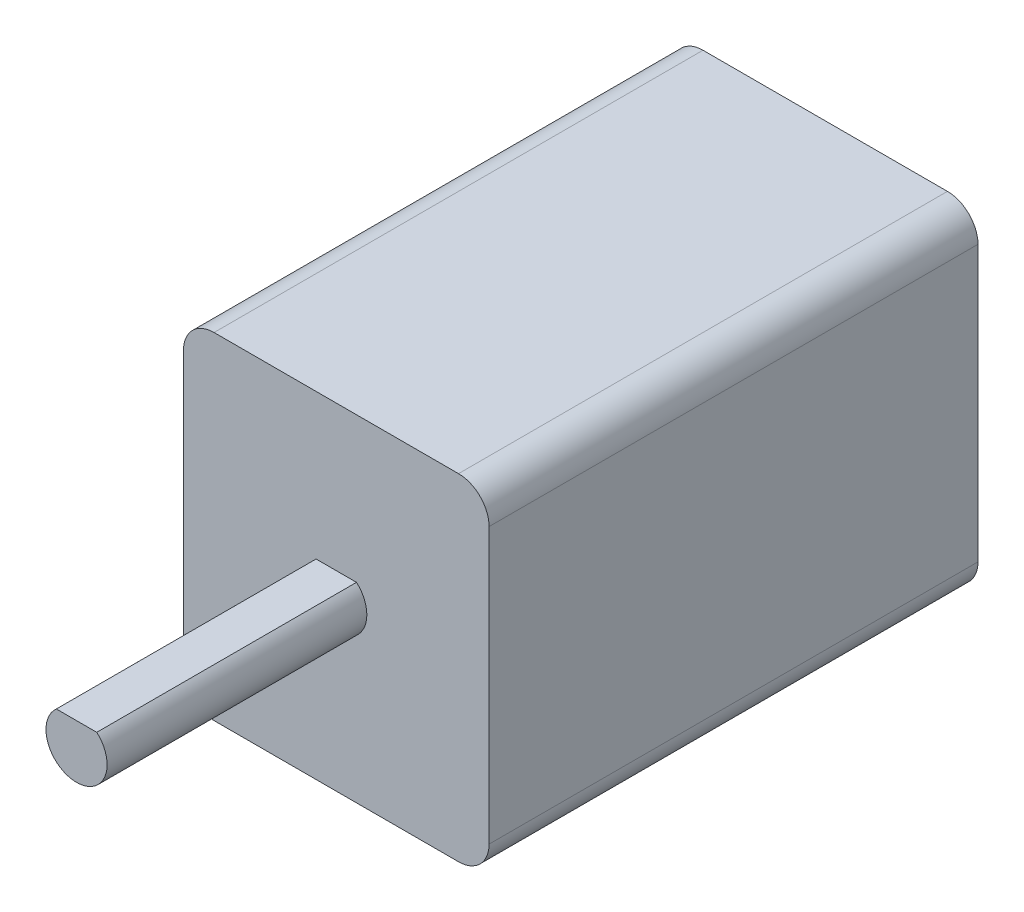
ISO-10303-21;
HEADER;
FILE_DESCRIPTION(('STEP AP214'),'2;1');
FILE_NAME('part.step','',(''),(''),'','','');
FILE_SCHEMA(('AUTOMOTIVE_DESIGN { 1 0 10303 214 1 1 1 1 }'));
ENDSEC;
DATA;
#1=APPLICATION_CONTEXT('core data for automotive mechanical design processes');
#2=APPLICATION_PROTOCOL_DEFINITION('international standard','automotive_design',2000,#1);
#3=PRODUCT_CONTEXT('',#1,'mechanical');
#4=PRODUCT('Part','Part','',(#3));
#5=PRODUCT_RELATED_PRODUCT_CATEGORY('part','',(#4));
#6=PRODUCT_DEFINITION_FORMATION('','',#4);
#7=PRODUCT_DEFINITION_CONTEXT('part definition',#1,'design');
#8=PRODUCT_DEFINITION('design','',#6,#7);
#9=PRODUCT_DEFINITION_SHAPE('','',#8);
#10=(LENGTH_UNIT() NAMED_UNIT(*) SI_UNIT(.MILLI.,.METRE.));
#11=(NAMED_UNIT(*) PLANE_ANGLE_UNIT() SI_UNIT($,.RADIAN.));
#12=(NAMED_UNIT(*) SI_UNIT($,.STERADIAN.) SOLID_ANGLE_UNIT());
#13=UNCERTAINTY_MEASURE_WITH_UNIT(LENGTH_MEASURE(1.E-05),#10,'distance_accuracy_value','');
#14=(GEOMETRIC_REPRESENTATION_CONTEXT(3) GLOBAL_UNCERTAINTY_ASSIGNED_CONTEXT((#13)) GLOBAL_UNIT_ASSIGNED_CONTEXT((#10,
#11,#12)) REPRESENTATION_CONTEXT('',''));
#15=CARTESIAN_POINT('',(0.,0.,0.));
#16=DIRECTION('',(0.,0.,1.));
#17=DIRECTION('',(1.,0.,0.));
#18=AXIS2_PLACEMENT_3D('',#15,#16,#17);
#19=CARTESIAN_POINT('',(10.,-11.,32.));
#20=DIRECTION('',(-1.,0.,0.));
#21=DIRECTION('',(0.,0.,1.));
#22=AXIS2_PLACEMENT_3D('',#19,#20,#21);
#23=PLANE('',#22);
#24=DIRECTION('',(0.,1.,0.));
#25=VECTOR('',#24,1.);
#26=CARTESIAN_POINT('',(10.,-11.,32.));
#27=LINE('',#26,#25);
#28=CARTESIAN_POINT('',(10.,-9.,32.));
#29=VERTEX_POINT('',#28);
#30=CARTESIAN_POINT('',(10.,9.,32.));
#31=VERTEX_POINT('',#30);
#32=EDGE_CURVE('E131',#29,#31,#27,.T.);
#33=ORIENTED_EDGE('',*,*,#32,.F.);
#34=DIRECTION('',(0.,0.,-1.));
#35=VECTOR('',#34,1.);
#36=CARTESIAN_POINT('',(10.,-9.,32.));
#37=LINE('',#36,#35);
#38=CARTESIAN_POINT('',(10.,-9.,0.));
#39=VERTEX_POINT('',#38);
#40=EDGE_CURVE('E154',#29,#39,#37,.T.);
#41=ORIENTED_EDGE('',*,*,#40,.T.);
#42=DIRECTION('',(0.,1.,0.));
#43=VECTOR('',#42,1.);
#44=CARTESIAN_POINT('',(10.,-11.,0.));
#45=LINE('',#44,#43);
#46=CARTESIAN_POINT('',(10.,9.,0.));
#47=VERTEX_POINT('',#46);
#48=EDGE_CURVE('E128',#39,#47,#45,.T.);
#49=ORIENTED_EDGE('',*,*,#48,.T.);
#50=DIRECTION('',(0.,0.,-1.));
#51=VECTOR('',#50,1.);
#52=CARTESIAN_POINT('',(10.,9.,32.));
#53=LINE('',#52,#51);
#54=EDGE_CURVE('E143',#47,#31,#53,.F.);
#55=ORIENTED_EDGE('',*,*,#54,.T.);
#56=EDGE_LOOP('',(#33,#41,#49,#55));
#57=FACE_BOUND('',#56,.T.);
#58=ADVANCED_FACE('F34',(#57),#23,.F.);
#59=CARTESIAN_POINT('',(-10.,11.,32.));
#60=DIRECTION('',(0.,-1.,0.));
#61=DIRECTION('',(0.,0.,-1.));
#62=AXIS2_PLACEMENT_3D('',#59,#60,#61);
#63=PLANE('',#62);
#64=DIRECTION('',(-1.,0.,0.));
#65=VECTOR('',#64,1.);
#66=CARTESIAN_POINT('',(-10.,11.,32.));
#67=LINE('',#66,#65);
#68=CARTESIAN_POINT('',(8.,11.,32.));
#69=VERTEX_POINT('',#68);
#70=CARTESIAN_POINT('',(-8.,11.,32.));
#71=VERTEX_POINT('',#70);
#72=EDGE_CURVE('E134',#69,#71,#67,.T.);
#73=ORIENTED_EDGE('',*,*,#72,.F.);
#74=DIRECTION('',(0.,0.,-1.));
#75=VECTOR('',#74,1.);
#76=CARTESIAN_POINT('',(8.,11.,32.));
#77=LINE('',#76,#75);
#78=CARTESIAN_POINT('',(8.,11.,0.));
#79=VERTEX_POINT('',#78);
#80=EDGE_CURVE('E42',#69,#79,#77,.T.);
#81=ORIENTED_EDGE('',*,*,#80,.T.);
#82=DIRECTION('',(-1.,0.,0.));
#83=VECTOR('',#82,1.);
#84=CARTESIAN_POINT('',(-10.,11.,0.));
#85=LINE('',#84,#83);
#86=CARTESIAN_POINT('',(-8.,11.,0.));
#87=VERTEX_POINT('',#86);
#88=EDGE_CURVE('E146',#79,#87,#85,.T.);
#89=ORIENTED_EDGE('',*,*,#88,.T.);
#90=DIRECTION('',(0.,0.,-1.));
#91=VECTOR('',#90,1.);
#92=CARTESIAN_POINT('',(-8.,11.,32.));
#93=LINE('',#92,#91);
#94=EDGE_CURVE('E182',#87,#71,#93,.F.);
#95=ORIENTED_EDGE('',*,*,#94,.T.);
#96=EDGE_LOOP('',(#73,#81,#89,#95));
#97=FACE_BOUND('',#96,.T.);
#98=ADVANCED_FACE('F188',(#97),#63,.F.);
#99=CARTESIAN_POINT('',(-10.,-11.,32.));
#100=DIRECTION('',(1.,0.,0.));
#101=DIRECTION('',(0.,0.,-1.));
#102=AXIS2_PLACEMENT_3D('',#99,#100,#101);
#103=PLANE('',#102);
#104=DIRECTION('',(0.,-1.,0.));
#105=VECTOR('',#104,1.);
#106=CARTESIAN_POINT('',(-10.,-11.,0.));
#107=LINE('',#106,#105);
#108=CARTESIAN_POINT('',(-10.,9.,0.));
#109=VERTEX_POINT('',#108);
#110=CARTESIAN_POINT('',(-10.,-9.,0.));
#111=VERTEX_POINT('',#110);
#112=EDGE_CURVE('E149',#109,#111,#107,.T.);
#113=ORIENTED_EDGE('',*,*,#112,.T.);
#114=DIRECTION('',(0.,0.,-1.));
#115=VECTOR('',#114,1.);
#116=CARTESIAN_POINT('',(-10.,-9.,32.));
#117=LINE('',#116,#115);
#118=CARTESIAN_POINT('',(-10.,-9.,32.));
#119=VERTEX_POINT('',#118);
#120=EDGE_CURVE('E57',#111,#119,#117,.F.);
#121=ORIENTED_EDGE('',*,*,#120,.T.);
#122=DIRECTION('',(0.,-1.,0.));
#123=VECTOR('',#122,1.);
#124=CARTESIAN_POINT('',(-10.,-11.,32.));
#125=LINE('',#124,#123);
#126=CARTESIAN_POINT('',(-10.,9.,32.));
#127=VERTEX_POINT('',#126);
#128=EDGE_CURVE('E138',#127,#119,#125,.T.);
#129=ORIENTED_EDGE('',*,*,#128,.F.);
#130=DIRECTION('',(0.,0.,-1.));
#131=VECTOR('',#130,1.);
#132=CARTESIAN_POINT('',(-10.,9.,32.));
#133=LINE('',#132,#131);
#134=EDGE_CURVE('E178',#127,#109,#133,.T.);
#135=ORIENTED_EDGE('',*,*,#134,.T.);
#136=EDGE_LOOP('',(#113,#121,#129,#135));
#137=FACE_BOUND('',#136,.T.);
#138=ADVANCED_FACE('F199',(#137),#103,.F.);
#139=CARTESIAN_POINT('',(-10.,-11.,32.));
#140=DIRECTION('',(0.,1.,0.));
#141=DIRECTION('',(0.,0.,1.));
#142=AXIS2_PLACEMENT_3D('',#139,#140,#141);
#143=PLANE('',#142);
#144=DIRECTION('',(1.,0.,0.));
#145=VECTOR('',#144,1.);
#146=CARTESIAN_POINT('',(-10.,-11.,0.));
#147=LINE('',#146,#145);
#148=CARTESIAN_POINT('',(-8.,-11.,0.));
#149=VERTEX_POINT('',#148);
#150=CARTESIAN_POINT('',(8.,-11.,0.));
#151=VERTEX_POINT('',#150);
#152=EDGE_CURVE('E135',#149,#151,#147,.T.);
#153=ORIENTED_EDGE('',*,*,#152,.T.);
#154=DIRECTION('',(0.,0.,-1.));
#155=VECTOR('',#154,1.);
#156=CARTESIAN_POINT('',(8.,-11.,32.));
#157=LINE('',#156,#155);
#158=CARTESIAN_POINT('',(8.,-11.,32.));
#159=VERTEX_POINT('',#158);
#160=EDGE_CURVE('E168',#151,#159,#157,.F.);
#161=ORIENTED_EDGE('',*,*,#160,.T.);
#162=DIRECTION('',(1.,0.,0.));
#163=VECTOR('',#162,1.);
#164=CARTESIAN_POINT('',(-10.,-11.,32.));
#165=LINE('',#164,#163);
#166=CARTESIAN_POINT('',(-8.,-11.,32.));
#167=VERTEX_POINT('',#166);
#168=EDGE_CURVE('E140',#167,#159,#165,.T.);
#169=ORIENTED_EDGE('',*,*,#168,.F.);
#170=DIRECTION('',(0.,0.,-1.));
#171=VECTOR('',#170,1.);
#172=CARTESIAN_POINT('',(-8.,-11.,32.));
#173=LINE('',#172,#171);
#174=EDGE_CURVE('E165',#167,#149,#173,.T.);
#175=ORIENTED_EDGE('',*,*,#174,.T.);
#176=EDGE_LOOP('',(#153,#161,#169,#175));
#177=FACE_BOUND('',#176,.T.);
#178=ADVANCED_FACE('F207',(#177),#143,.F.);
#179=CARTESIAN_POINT('',(0.,0.,32.));
#180=DIRECTION('',(0.,0.,-1.));
#181=DIRECTION('',(-1.,0.,0.));
#182=AXIS2_PLACEMENT_3D('',#179,#180,#181);
#183=PLANE('',#182);
#184=CARTESIAN_POINT('',(0.,0.,32.));
#185=DIRECTION('',(0.,0.,-1.));
#186=DIRECTION('',(-1.,0.,0.));
#187=AXIS2_PLACEMENT_3D('',#184,#185,#186);
#188=CIRCLE('',#187,2.);
#189=CARTESIAN_POINT('',(-1.3228756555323,1.5,32.));
#190=VERTEX_POINT('',#189);
#191=CARTESIAN_POINT('',(1.3228756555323,1.5,32.));
#192=VERTEX_POINT('',#191);
#193=EDGE_CURVE('E11',#190,#192,#188,.F.);
#194=ORIENTED_EDGE('',*,*,#193,.F.);
#195=DIRECTION('',(1.,0.,0.));
#196=VECTOR('',#195,1.);
#197=CARTESIAN_POINT('',(-1.3228756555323,1.5,32.));
#198=LINE('',#197,#196);
#199=EDGE_CURVE('E114',#190,#192,#198,.T.);
#200=ORIENTED_EDGE('',*,*,#199,.T.);
#201=EDGE_LOOP('',(#194,#200));
#202=FACE_BOUND('',#201,.T.);
#203=ORIENTED_EDGE('',*,*,#168,.T.);
#204=CARTESIAN_POINT('',(8.,-9.,32.));
#205=DIRECTION('',(0.,0.,-1.));
#206=DIRECTION('',(-1.,0.,0.));
#207=AXIS2_PLACEMENT_3D('',#204,#205,#206);
#208=CIRCLE('',#207,2.);
#209=EDGE_CURVE('E176',#159,#29,#208,.F.);
#210=ORIENTED_EDGE('',*,*,#209,.T.);
#211=ORIENTED_EDGE('',*,*,#32,.T.);
#212=CARTESIAN_POINT('',(8.,9.,32.));
#213=DIRECTION('',(0.,0.,-1.));
#214=DIRECTION('',(-1.,0.,0.));
#215=AXIS2_PLACEMENT_3D('',#212,#213,#214);
#216=CIRCLE('',#215,2.);
#217=EDGE_CURVE('E172',#31,#69,#216,.F.);
#218=ORIENTED_EDGE('',*,*,#217,.T.);
#219=ORIENTED_EDGE('',*,*,#72,.T.);
#220=CARTESIAN_POINT('',(-8.,9.,32.));
#221=DIRECTION('',(0.,0.,-1.));
#222=DIRECTION('',(-1.,0.,0.));
#223=AXIS2_PLACEMENT_3D('',#220,#221,#222);
#224=CIRCLE('',#223,2.);
#225=EDGE_CURVE('E170',#71,#127,#224,.F.);
#226=ORIENTED_EDGE('',*,*,#225,.T.);
#227=ORIENTED_EDGE('',*,*,#128,.T.);
#228=CARTESIAN_POINT('',(-8.,-9.,32.));
#229=DIRECTION('',(0.,0.,-1.));
#230=DIRECTION('',(-1.,0.,0.));
#231=AXIS2_PLACEMENT_3D('',#228,#229,#230);
#232=CIRCLE('',#231,2.);
#233=EDGE_CURVE('E174',#119,#167,#232,.F.);
#234=ORIENTED_EDGE('',*,*,#233,.T.);
#235=EDGE_LOOP('',(#203,#210,#211,#218,#219,#226,#227,#234));
#236=FACE_BOUND('',#235,.T.);
#237=ADVANCED_FACE('F122',(#202,#236),#183,.F.);
#238=CARTESIAN_POINT('',(0.,0.,0.));
#239=DIRECTION('',(0.,0.,-1.));
#240=DIRECTION('',(-1.,0.,0.));
#241=AXIS2_PLACEMENT_3D('',#238,#239,#240);
#242=PLANE('',#241);
#243=ORIENTED_EDGE('',*,*,#48,.F.);
#244=CARTESIAN_POINT('',(8.,-9.,0.));
#245=DIRECTION('',(0.,0.,-1.));
#246=DIRECTION('',(-1.,0.,0.));
#247=AXIS2_PLACEMENT_3D('',#244,#245,#246);
#248=CIRCLE('',#247,2.);
#249=EDGE_CURVE('E163',#39,#151,#248,.T.);
#250=ORIENTED_EDGE('',*,*,#249,.T.);
#251=ORIENTED_EDGE('',*,*,#152,.F.);
#252=CARTESIAN_POINT('',(-8.,-9.,0.));
#253=DIRECTION('',(0.,0.,-1.));
#254=DIRECTION('',(-1.,0.,0.));
#255=AXIS2_PLACEMENT_3D('',#252,#253,#254);
#256=CIRCLE('',#255,2.);
#257=EDGE_CURVE('E161',#149,#111,#256,.T.);
#258=ORIENTED_EDGE('',*,*,#257,.T.);
#259=ORIENTED_EDGE('',*,*,#112,.F.);
#260=CARTESIAN_POINT('',(-8.,9.,0.));
#261=DIRECTION('',(0.,0.,-1.));
#262=DIRECTION('',(-1.,0.,0.));
#263=AXIS2_PLACEMENT_3D('',#260,#261,#262);
#264=CIRCLE('',#263,2.);
#265=EDGE_CURVE('E157',#109,#87,#264,.T.);
#266=ORIENTED_EDGE('',*,*,#265,.T.);
#267=ORIENTED_EDGE('',*,*,#88,.F.);
#268=CARTESIAN_POINT('',(8.,9.,0.));
#269=DIRECTION('',(0.,0.,-1.));
#270=DIRECTION('',(-1.,0.,0.));
#271=AXIS2_PLACEMENT_3D('',#268,#269,#270);
#272=CIRCLE('',#271,2.);
#273=EDGE_CURVE('E159',#79,#47,#272,.T.);
#274=ORIENTED_EDGE('',*,*,#273,.T.);
#275=EDGE_LOOP('',(#243,#250,#251,#258,#259,#266,#267,#274));
#276=FACE_BOUND('',#275,.T.);
#277=ADVANCED_FACE('F194',(#276),#242,.T.);
#278=CARTESIAN_POINT('',(8.,-9.,32.));
#279=DIRECTION('',(0.,0.,-1.));
#280=DIRECTION('',(-1.,0.,0.));
#281=AXIS2_PLACEMENT_3D('',#278,#279,#280);
#282=CYLINDRICAL_SURFACE('',#281,2.);
#283=ORIENTED_EDGE('',*,*,#209,.F.);
#284=ORIENTED_EDGE('',*,*,#160,.F.);
#285=ORIENTED_EDGE('',*,*,#249,.F.);
#286=ORIENTED_EDGE('',*,*,#40,.F.);
#287=EDGE_LOOP('',(#283,#284,#285,#286));
#288=FACE_BOUND('',#287,.T.);
#289=ADVANCED_FACE('F212',(#288),#282,.T.);
#290=CARTESIAN_POINT('',(-8.,-9.,32.));
#291=DIRECTION('',(0.,0.,-1.));
#292=DIRECTION('',(-1.,0.,0.));
#293=AXIS2_PLACEMENT_3D('',#290,#291,#292);
#294=CYLINDRICAL_SURFACE('',#293,2.);
#295=ORIENTED_EDGE('',*,*,#233,.F.);
#296=ORIENTED_EDGE('',*,*,#120,.F.);
#297=ORIENTED_EDGE('',*,*,#257,.F.);
#298=ORIENTED_EDGE('',*,*,#174,.F.);
#299=EDGE_LOOP('',(#295,#296,#297,#298));
#300=FACE_BOUND('',#299,.T.);
#301=ADVANCED_FACE('F204',(#300),#294,.T.);
#302=CARTESIAN_POINT('',(8.,9.,32.));
#303=DIRECTION('',(0.,0.,-1.));
#304=DIRECTION('',(-1.,0.,0.));
#305=AXIS2_PLACEMENT_3D('',#302,#303,#304);
#306=CYLINDRICAL_SURFACE('',#305,2.);
#307=ORIENTED_EDGE('',*,*,#217,.F.);
#308=ORIENTED_EDGE('',*,*,#54,.F.);
#309=ORIENTED_EDGE('',*,*,#273,.F.);
#310=ORIENTED_EDGE('',*,*,#80,.F.);
#311=EDGE_LOOP('',(#307,#308,#309,#310));
#312=FACE_BOUND('',#311,.T.);
#313=ADVANCED_FACE('F216',(#312),#306,.T.);
#314=CARTESIAN_POINT('',(-8.,9.,32.));
#315=DIRECTION('',(0.,0.,-1.));
#316=DIRECTION('',(-1.,0.,0.));
#317=AXIS2_PLACEMENT_3D('',#314,#315,#316);
#318=CYLINDRICAL_SURFACE('',#317,2.);
#319=ORIENTED_EDGE('',*,*,#225,.F.);
#320=ORIENTED_EDGE('',*,*,#94,.F.);
#321=ORIENTED_EDGE('',*,*,#265,.F.);
#322=ORIENTED_EDGE('',*,*,#134,.F.);
#323=EDGE_LOOP('',(#319,#320,#321,#322));
#324=FACE_BOUND('',#323,.T.);
#325=ADVANCED_FACE('F36',(#324),#318,.T.);
#326=CARTESIAN_POINT('',(0.,0.,49.));
#327=DIRECTION('',(0.,0.,-1.));
#328=DIRECTION('',(-1.,0.,0.));
#329=AXIS2_PLACEMENT_3D('',#326,#327,#328);
#330=CYLINDRICAL_SURFACE('',#329,2.);
#331=CARTESIAN_POINT('',(0.,0.,49.));
#332=DIRECTION('',(0.,0.,1.));
#333=DIRECTION('',(1.,0.,0.));
#334=AXIS2_PLACEMENT_3D('',#331,#332,#333);
#335=CIRCLE('',#334,2.);
#336=CARTESIAN_POINT('',(-1.3228756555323,1.5,49.));
#337=VERTEX_POINT('',#336);
#338=CARTESIAN_POINT('',(1.3228756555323,1.5,49.));
#339=VERTEX_POINT('',#338);
#340=EDGE_CURVE('E126',#337,#339,#335,.T.);
#341=ORIENTED_EDGE('',*,*,#340,.F.);
#342=DIRECTION('',(0.,0.,1.));
#343=VECTOR('',#342,1.);
#344=CARTESIAN_POINT('',(-1.3228756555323,1.5,29.3074175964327));
#345=LINE('',#344,#343);
#346=EDGE_CURVE('E49',#190,#337,#345,.T.);
#347=ORIENTED_EDGE('',*,*,#346,.F.);
#348=ORIENTED_EDGE('',*,*,#193,.T.);
#349=DIRECTION('',(0.,0.,1.));
#350=VECTOR('',#349,1.);
#351=CARTESIAN_POINT('',(1.3228756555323,1.5,29.3074175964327));
#352=LINE('',#351,#350);
#353=EDGE_CURVE('E111',#192,#339,#352,.T.);
#354=ORIENTED_EDGE('',*,*,#353,.T.);
#355=EDGE_LOOP('',(#341,#347,#348,#354));
#356=FACE_BOUND('',#355,.T.);
#357=ADVANCED_FACE('F125',(#356),#330,.T.);
#358=CARTESIAN_POINT('',(0.,0.,49.));
#359=DIRECTION('',(0.,0.,1.));
#360=DIRECTION('',(1.,0.,0.));
#361=AXIS2_PLACEMENT_3D('',#358,#359,#360);
#362=PLANE('',#361);
#363=DIRECTION('',(1.,0.,0.));
#364=VECTOR('',#363,1.);
#365=CARTESIAN_POINT('',(-1.3228756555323,1.5,49.));
#366=LINE('',#365,#364);
#367=EDGE_CURVE('E115',#337,#339,#366,.T.);
#368=ORIENTED_EDGE('',*,*,#367,.F.);
#369=ORIENTED_EDGE('',*,*,#340,.T.);
#370=EDGE_LOOP('',(#368,#369));
#371=FACE_BOUND('',#370,.T.);
#372=ADVANCED_FACE('F271',(#371),#362,.T.);
#373=CARTESIAN_POINT('',(-1.3228756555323,1.5,29.3074175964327));
#374=DIRECTION('',(0.,-1.,0.));
#375=DIRECTION('',(0.,0.,-1.));
#376=AXIS2_PLACEMENT_3D('',#373,#374,#375);
#377=PLANE('',#376);
#378=ORIENTED_EDGE('',*,*,#346,.T.);
#379=ORIENTED_EDGE('',*,*,#367,.T.);
#380=ORIENTED_EDGE('',*,*,#353,.F.);
#381=ORIENTED_EDGE('',*,*,#199,.F.);
#382=EDGE_LOOP('',(#378,#379,#380,#381));
#383=FACE_BOUND('',#382,.T.);
#384=ADVANCED_FACE('F113',(#383),#377,.F.);
#385=CLOSED_SHELL('',(#58,#98,#138,#178,#237,#277,#289,#301,#313,#325,#357,#372,#384));
#386=MANIFOLD_SOLID_BREP('B2',#385);
#387=ADVANCED_BREP_SHAPE_REPRESENTATION('',(#18,#386),#14);
#388=SHAPE_DEFINITION_REPRESENTATION(#9,#387);
ENDSEC;
END-ISO-10303-21;
